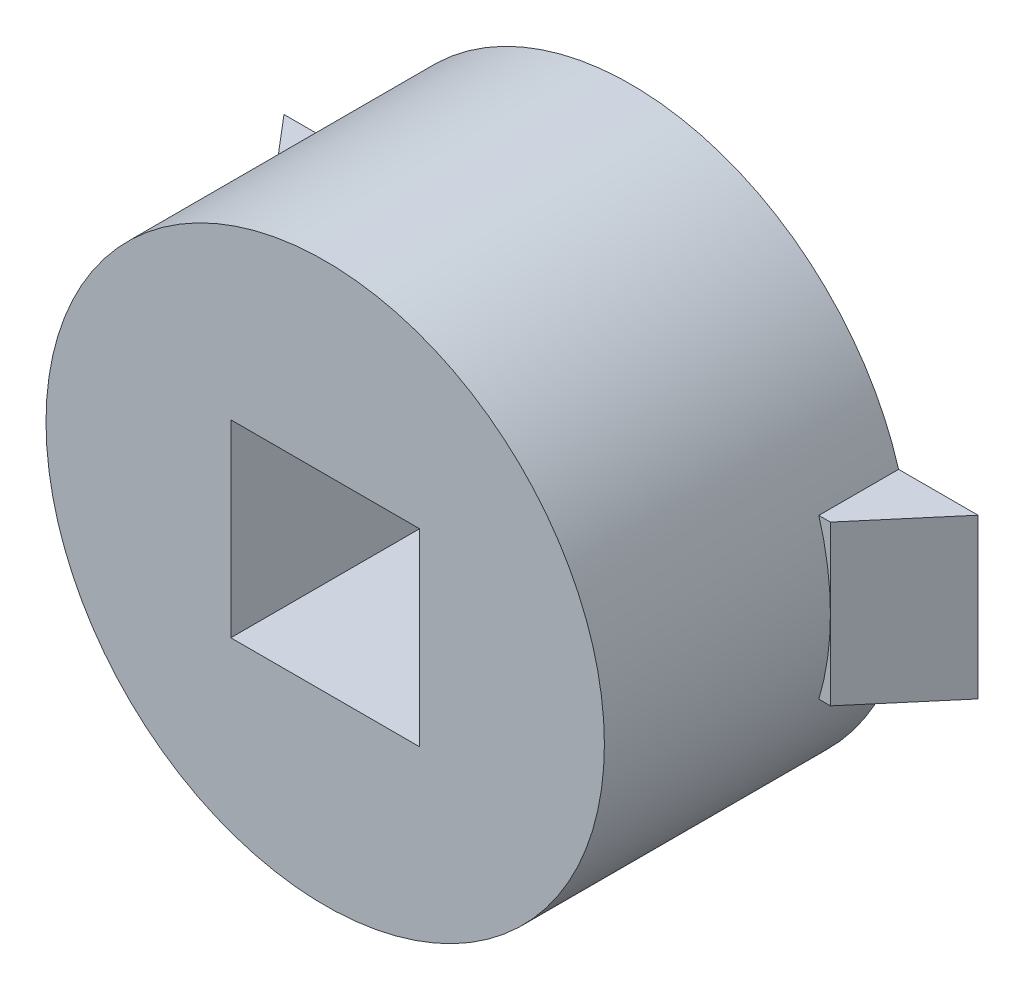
from build123d import *

# Parameters (mm, degrees)
SKETCH1_R           = 21
BOSS_EXTRUDE1_DEPTH = 23
SKETCH2_W           = 14.2
SKETCH2_H           = 14.2
CUT_EXTRUDE1_DEPTH  = 22
SKETCH3_R           = 6.5
CUT_EXTRUDE2_DEPTH  = 22
SKETCH6_W           = 10.199811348
SKETCH6_H           = 11.971019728
BOSS_EXTRUDE2_DEPTH = 6
CUT_EXTRUDE3_DEPTH  = 14


with BuildPart() as part:
    # Sketch1 → Boss-Extrude1 (new body)
    with BuildSketch(Plane.XY):
        Circle(SKETCH1_R)
    extrude(amount=BOSS_EXTRUDE1_DEPTH)

    # Sketch2 → Cut-Extrude1 (cut)
    with BuildSketch(Plane.XY.offset(23)):
        Rectangle(SKETCH2_W, SKETCH2_H)
    extrude(amount=-CUT_EXTRUDE1_DEPTH, mode=Mode.SUBTRACT)

    # Sketch3 → Cut-Extrude2 (cut)
    with BuildSketch(Plane.XY.offset(1)):
        Circle(SKETCH3_R)
    extrude(amount=-CUT_EXTRUDE2_DEPTH, mode=Mode.SUBTRACT)

    # Sketch6 → Boss-Extrude2 (add)
    with BuildSketch(Plane(origin=(0, 0, 0), x_dir=(-1, 0, 0), z_dir=(0, 0, -1))):
        with Locations((-21, 0)):
            Rectangle(SKETCH6_W, SKETCH6_H)
        with Locations((21, 0)):
            Rectangle(SKETCH6_W, SKETCH6_H)
    extrude(amount=-BOSS_EXTRUDE2_DEPTH)

    # Sketch7 → Cut-Extrude3 (cut)
    with BuildSketch(Plane.XZ.offset(5.985509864)):
        Polygon((-26.099905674, 0), (-21, 6), (-26.099905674, 6), align=None)
        Polygon((26.099905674, 0), (21, 6), (26.099905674, 6), align=None)
    extrude(amount=-CUT_EXTRUDE3_DEPTH, mode=Mode.SUBTRACT)


solid = part.part
